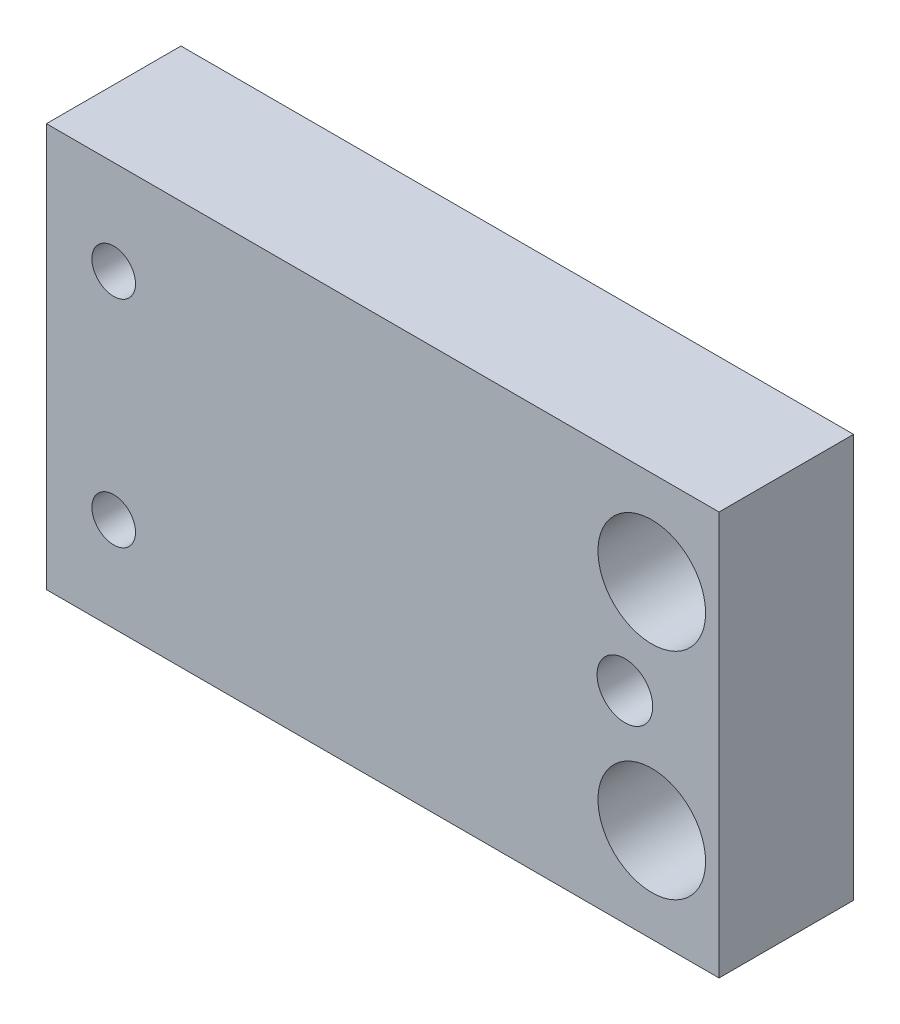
from build123d import *

# Parameters (mm, degrees)
ESQUISSE1_W             = 50
ESQUISSE1_H             = 30
BOSS_EXTRU_1_DEPTH      = 10
ESQUISSE2_W             = 2.067
ESQUISSE2_H             = 10
ESQUISSE3_W             = 1.621
ESQUISSE3_H             = 10
ESQUISSE4_W             = 1.621
ESQUISSE4_H             = 10
ESQUISSE5_R             = 4
ENL_V_MAT_EXTRU_1_DEPTH = 10
ESQUISSE6_R             = 4
ENL_V_MAT_EXTRU_2_DEPTH = 10


with BuildPart() as part:
    # Esquisse1 → Boss.-Extru.1 (new body)
    with BuildSketch(Plane.XY):
        Rectangle(ESQUISSE1_W, ESQUISSE1_H)
    extrude(amount=BOSS_EXTRU_1_DEPTH)

    # Esquisse2 → Enl_vement de mati_re-R_volution1 (revolve, cut)
    with BuildSketch(Plane(origin=(0, 0, 0), x_dir=(-1, 0, 0), z_dir=(0, 1, 0)), mode=Mode.PRIVATE) as enl_vement_de_mati_re_r_volution1_sk:
        with Locations((-19.0335, 5)):
            Rectangle(ESQUISSE2_W, ESQUISSE2_H)
    revolve(enl_vement_de_mati_re_r_volution1_sk.sketch.rotate(Axis((18, 0, 10), (0, 0, -1)), 180), axis=Axis((18, 0, 10), (0, 0, -1)), mode=Mode.SUBTRACT)

    # Esquisse3 → Enl_vement de mati_re-R_volution2 (revolve, cut)
    with BuildSketch(Plane(origin=(0, 8, 0), x_dir=(-1, 0, 0), z_dir=(0, 1, 0)), mode=Mode.PRIVATE) as enl_vement_de_mati_re_r_volution2_sk:
        with Locations((20.8105, 5)):
            Rectangle(ESQUISSE3_W, ESQUISSE3_H)
    revolve(enl_vement_de_mati_re_r_volution2_sk.sketch.rotate(Axis((-20, 8, 0), (0, 0, 1)), 180), axis=Axis((-20, 8, 0), (0, 0, 1)), mode=Mode.SUBTRACT)

    # Esquisse4 → Enl_vement de mati_re-R_volution3 (revolve, cut)
    with BuildSketch(Plane(origin=(0, -8, 0), x_dir=(-1, 0, 0), z_dir=(0, 1, 0)), mode=Mode.PRIVATE) as enl_vement_de_mati_re_r_volution3_sk:
        with Locations((20.8105, 5)):
            Rectangle(ESQUISSE4_W, ESQUISSE4_H)
    revolve(enl_vement_de_mati_re_r_volution3_sk.sketch.rotate(Axis((-20, -8, 0), (0, 0, 1)), 180), axis=Axis((-20, -8, 0), (0, 0, 1)), mode=Mode.SUBTRACT)

    # Esquisse5 → Enl_v. mat.-Extru.1 (cut)
    with BuildSketch(Plane.XY):
        with Locations((20, 8)):
            Circle(ESQUISSE5_R)
    extrude(amount=ENL_V_MAT_EXTRU_1_DEPTH, mode=Mode.SUBTRACT)

    # Esquisse6 → Enl_v. mat.-Extru.2 (cut)
    with BuildSketch(Plane.XY):
        with Locations((20, -8)):
            Circle(ESQUISSE6_R)
    extrude(amount=ENL_V_MAT_EXTRU_2_DEPTH, mode=Mode.SUBTRACT)


solid = part.part
